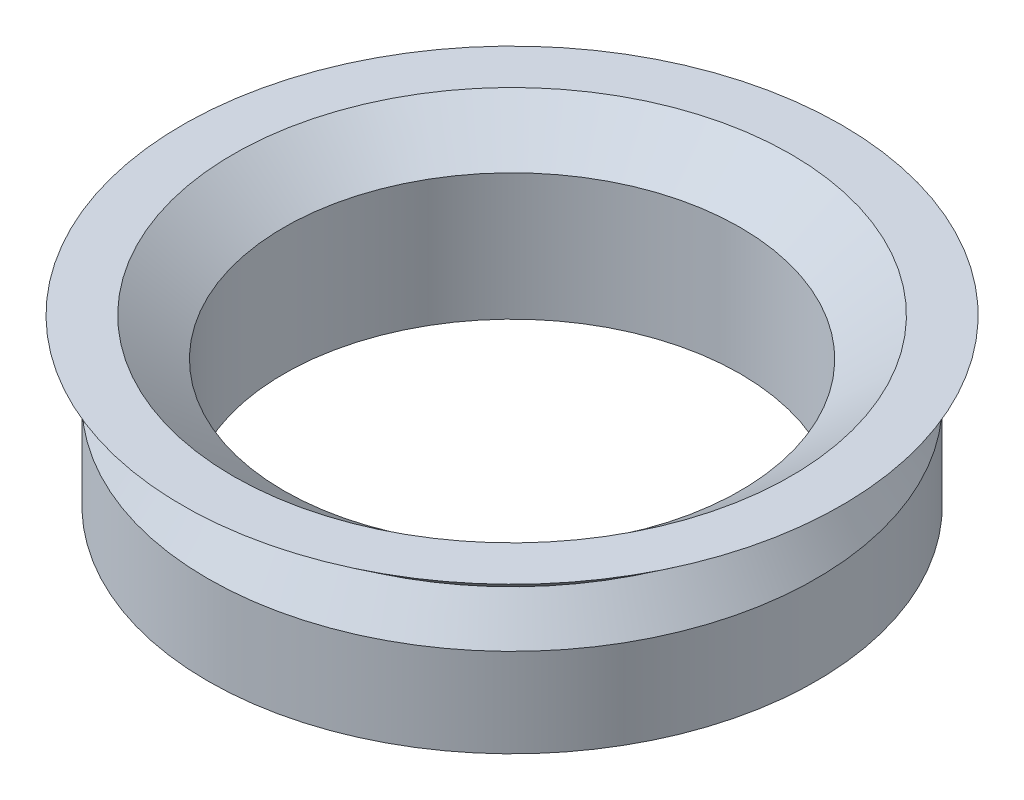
ISO-10303-21;
HEADER;
FILE_DESCRIPTION(('STEP AP214'),'2;1');
FILE_NAME('part.step','',(''),(''),'','','');
FILE_SCHEMA(('AUTOMOTIVE_DESIGN { 1 0 10303 214 1 1 1 1 }'));
ENDSEC;
DATA;
#1=APPLICATION_CONTEXT('core data for automotive mechanical design processes');
#2=APPLICATION_PROTOCOL_DEFINITION('international standard','automotive_design',2000,#1);
#3=PRODUCT_CONTEXT('',#1,'mechanical');
#4=PRODUCT('Part','Part','',(#3));
#5=PRODUCT_RELATED_PRODUCT_CATEGORY('part','',(#4));
#6=PRODUCT_DEFINITION_FORMATION('','',#4);
#7=PRODUCT_DEFINITION_CONTEXT('part definition',#1,'design');
#8=PRODUCT_DEFINITION('design','',#6,#7);
#9=PRODUCT_DEFINITION_SHAPE('','',#8);
#10=(LENGTH_UNIT() NAMED_UNIT(*) SI_UNIT(.MILLI.,.METRE.));
#11=(NAMED_UNIT(*) PLANE_ANGLE_UNIT() SI_UNIT($,.RADIAN.));
#12=(NAMED_UNIT(*) SI_UNIT($,.STERADIAN.) SOLID_ANGLE_UNIT());
#13=UNCERTAINTY_MEASURE_WITH_UNIT(LENGTH_MEASURE(1.E-05),#10,'distance_accuracy_value','');
#14=(GEOMETRIC_REPRESENTATION_CONTEXT(3) GLOBAL_UNCERTAINTY_ASSIGNED_CONTEXT((#13)) GLOBAL_UNIT_ASSIGNED_CONTEXT((#10,
#11,#12)) REPRESENTATION_CONTEXT('',''));
#15=CARTESIAN_POINT('',(0.,0.,0.));
#16=DIRECTION('',(0.,0.,1.));
#17=DIRECTION('',(1.,0.,0.));
#18=AXIS2_PLACEMENT_3D('',#15,#16,#17);
#19=CARTESIAN_POINT('',(9.,0.,0.));
#20=DIRECTION('',(0.,-1.,0.));
#21=DIRECTION('',(0.,0.,-1.));
#22=AXIS2_PLACEMENT_3D('',#19,#20,#21);
#23=PLANE('',#22);
#24=CARTESIAN_POINT('',(0.,0.,0.));
#25=DIRECTION('',(0.,-1.,0.));
#26=DIRECTION('',(0.,0.,-1.));
#27=AXIS2_PLACEMENT_3D('',#24,#25,#26);
#28=CIRCLE('',#27,12.);
#29=CARTESIAN_POINT('',(0.,0.,-12.));
#30=VERTEX_POINT('',#29);
#31=EDGE_CURVE('E10',#30,#30,#28,.T.);
#32=ORIENTED_EDGE('',*,*,#31,.T.);
#33=EDGE_LOOP('',(#32));
#34=FACE_BOUND('',#33,.T.);
#35=CARTESIAN_POINT('',(0.,0.,0.));
#36=DIRECTION('',(0.,-1.,0.));
#37=DIRECTION('',(0.,0.,-1.));
#38=AXIS2_PLACEMENT_3D('',#35,#36,#37);
#39=CIRCLE('',#38,9.);
#40=CARTESIAN_POINT('',(0.,0.,-9.));
#41=VERTEX_POINT('',#40);
#42=EDGE_CURVE('E53',#41,#41,#39,.T.);
#43=ORIENTED_EDGE('',*,*,#42,.F.);
#44=EDGE_LOOP('',(#43));
#45=FACE_BOUND('',#44,.T.);
#46=ADVANCED_FACE('F28',(#34,#45),#23,.T.);
#47=CARTESIAN_POINT('',(0.,-24.2488615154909,0.));
#48=DIRECTION('',(0.,-1.,0.));
#49=DIRECTION('',(0.,0.,-1.));
#50=AXIS2_PLACEMENT_3D('',#47,#48,#49);
#51=CYLINDRICAL_SURFACE('',#50,12.);
#52=CARTESIAN_POINT('',(0.,3.5,0.));
#53=DIRECTION('',(0.,-1.,0.));
#54=DIRECTION('',(0.,0.,-1.));
#55=AXIS2_PLACEMENT_3D('',#52,#53,#54);
#56=CIRCLE('',#55,12.);
#57=CARTESIAN_POINT('',(0.,3.5,-12.));
#58=VERTEX_POINT('',#57);
#59=EDGE_CURVE('E34',#58,#58,#56,.T.);
#60=ORIENTED_EDGE('',*,*,#59,.T.);
#61=EDGE_LOOP('',(#60));
#62=FACE_BOUND('',#61,.T.);
#63=ORIENTED_EDGE('',*,*,#31,.F.);
#64=EDGE_LOOP('',(#63));
#65=FACE_BOUND('',#64,.T.);
#66=ADVANCED_FACE('F61',(#62,#65),#51,.T.);
#67=CARTESIAN_POINT('',(0.,3.5,0.));
#68=DIRECTION('',(0.,-1.,0.));
#69=DIRECTION('',(0.,0.,-1.));
#70=AXIS2_PLACEMENT_3D('',#67,#68,#69);
#71=CONICAL_SURFACE('',#70,12.,0.588002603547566);
#72=CARTESIAN_POINT('',(0.,5.,0.));
#73=DIRECTION('',(0.,-1.,0.));
#74=DIRECTION('',(0.,0.,-1.));
#75=AXIS2_PLACEMENT_3D('',#72,#73,#74);
#76=CIRCLE('',#75,11.);
#77=CARTESIAN_POINT('',(0.,5.,-11.));
#78=VERTEX_POINT('',#77);
#79=EDGE_CURVE('E38',#78,#78,#76,.T.);
#80=ORIENTED_EDGE('',*,*,#79,.T.);
#81=EDGE_LOOP('',(#80));
#82=FACE_BOUND('',#81,.T.);
#83=ORIENTED_EDGE('',*,*,#59,.F.);
#84=EDGE_LOOP('',(#83));
#85=FACE_BOUND('',#84,.T.);
#86=ADVANCED_FACE('F65',(#82,#85),#71,.T.);
#87=CARTESIAN_POINT('',(0.,5.,0.));
#88=DIRECTION('',(0.,1.,0.));
#89=DIRECTION('',(0.,0.,1.));
#90=AXIS2_PLACEMENT_3D('',#87,#88,#89);
#91=CONICAL_SURFACE('',#90,11.,0.927295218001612);
#92=CARTESIAN_POINT('',(0.,6.5,0.));
#93=DIRECTION('',(0.,-1.,0.));
#94=DIRECTION('',(0.,0.,-1.));
#95=AXIS2_PLACEMENT_3D('',#92,#93,#94);
#96=CIRCLE('',#95,13.);
#97=CARTESIAN_POINT('',(0.,6.5,-13.));
#98=VERTEX_POINT('',#97);
#99=EDGE_CURVE('E42',#98,#98,#96,.T.);
#100=ORIENTED_EDGE('',*,*,#99,.T.);
#101=EDGE_LOOP('',(#100));
#102=FACE_BOUND('',#101,.T.);
#103=ORIENTED_EDGE('',*,*,#79,.F.);
#104=EDGE_LOOP('',(#103));
#105=FACE_BOUND('',#104,.T.);
#106=ADVANCED_FACE('F69',(#102,#105),#91,.T.);
#107=CARTESIAN_POINT('',(13.,6.5,0.));
#108=DIRECTION('',(0.,1.,0.));
#109=DIRECTION('',(0.,0.,1.));
#110=AXIS2_PLACEMENT_3D('',#107,#108,#109);
#111=PLANE('',#110);
#112=CARTESIAN_POINT('',(0.,6.5,0.));
#113=DIRECTION('',(0.,-1.,0.));
#114=DIRECTION('',(0.,0.,-1.));
#115=AXIS2_PLACEMENT_3D('',#112,#113,#114);
#116=CIRCLE('',#115,11.);
#117=CARTESIAN_POINT('',(0.,6.5,-11.));
#118=VERTEX_POINT('',#117);
#119=EDGE_CURVE('E47',#118,#118,#116,.T.);
#120=ORIENTED_EDGE('',*,*,#119,.T.);
#121=EDGE_LOOP('',(#120));
#122=FACE_BOUND('',#121,.T.);
#123=ORIENTED_EDGE('',*,*,#99,.F.);
#124=EDGE_LOOP('',(#123));
#125=FACE_BOUND('',#124,.T.);
#126=ADVANCED_FACE('F76',(#122,#125),#111,.T.);
#127=CARTESIAN_POINT('',(0.,6.5,0.));
#128=DIRECTION('',(0.,1.,0.));
#129=DIRECTION('',(0.,0.,1.));
#130=AXIS2_PLACEMENT_3D('',#127,#128,#129);
#131=CONICAL_SURFACE('',#130,11.,0.927295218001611);
#132=CARTESIAN_POINT('',(0.,5.,0.));
#133=DIRECTION('',(0.,-1.,0.));
#134=DIRECTION('',(0.,0.,-1.));
#135=AXIS2_PLACEMENT_3D('',#132,#133,#134);
#136=CIRCLE('',#135,9.);
#137=CARTESIAN_POINT('',(0.,5.,-9.));
#138=VERTEX_POINT('',#137);
#139=EDGE_CURVE('E50',#138,#138,#136,.T.);
#140=ORIENTED_EDGE('',*,*,#139,.T.);
#141=EDGE_LOOP('',(#140));
#142=FACE_BOUND('',#141,.T.);
#143=ORIENTED_EDGE('',*,*,#119,.F.);
#144=EDGE_LOOP('',(#143));
#145=FACE_BOUND('',#144,.T.);
#146=ADVANCED_FACE('F80',(#142,#145),#131,.F.);
#147=CARTESIAN_POINT('',(0.,-24.2488615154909,0.));
#148=DIRECTION('',(0.,-1.,0.));
#149=DIRECTION('',(0.,0.,-1.));
#150=AXIS2_PLACEMENT_3D('',#147,#148,#149);
#151=CYLINDRICAL_SURFACE('',#150,9.);
#152=ORIENTED_EDGE('',*,*,#42,.T.);
#153=EDGE_LOOP('',(#152));
#154=FACE_BOUND('',#153,.T.);
#155=ORIENTED_EDGE('',*,*,#139,.F.);
#156=EDGE_LOOP('',(#155));
#157=FACE_BOUND('',#156,.T.);
#158=ADVANCED_FACE('F57',(#154,#157),#151,.F.);
#159=CLOSED_SHELL('',(#46,#66,#86,#106,#126,#146,#158));
#160=MANIFOLD_SOLID_BREP('B2',#159);
#161=ADVANCED_BREP_SHAPE_REPRESENTATION('',(#18,#160),#14);
#162=SHAPE_DEFINITION_REPRESENTATION(#9,#161);
ENDSEC;
END-ISO-10303-21;
